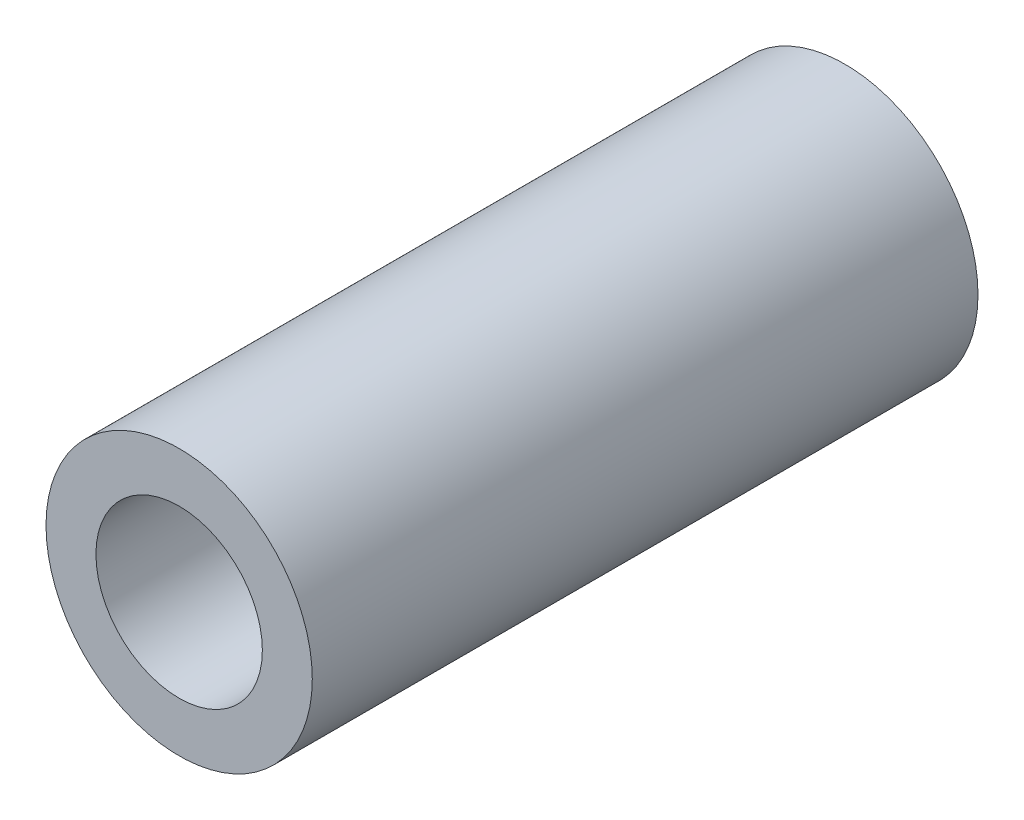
from build123d import *

# Parameters (mm, degrees)
SKETCH1_R           = 5.08
BOSS_EXTRUDE1_DEPTH = 25.4
SKETCH2_R           = 3.175
CUT_EXTRUDE1_DEPTH  = 25.4


with BuildPart() as part:
    # Sketch1 → Boss-Extrude1 (new body)
    with BuildSketch(Plane.XY):
        Circle(SKETCH1_R)
    extrude(amount=BOSS_EXTRUDE1_DEPTH)

    # Sketch2 → Cut-Extrude1 (cut)
    with BuildSketch(Plane.XY.offset(25.4)):
        Circle(SKETCH2_R)
    extrude(amount=-CUT_EXTRUDE1_DEPTH, mode=Mode.SUBTRACT)


solid = part.part
